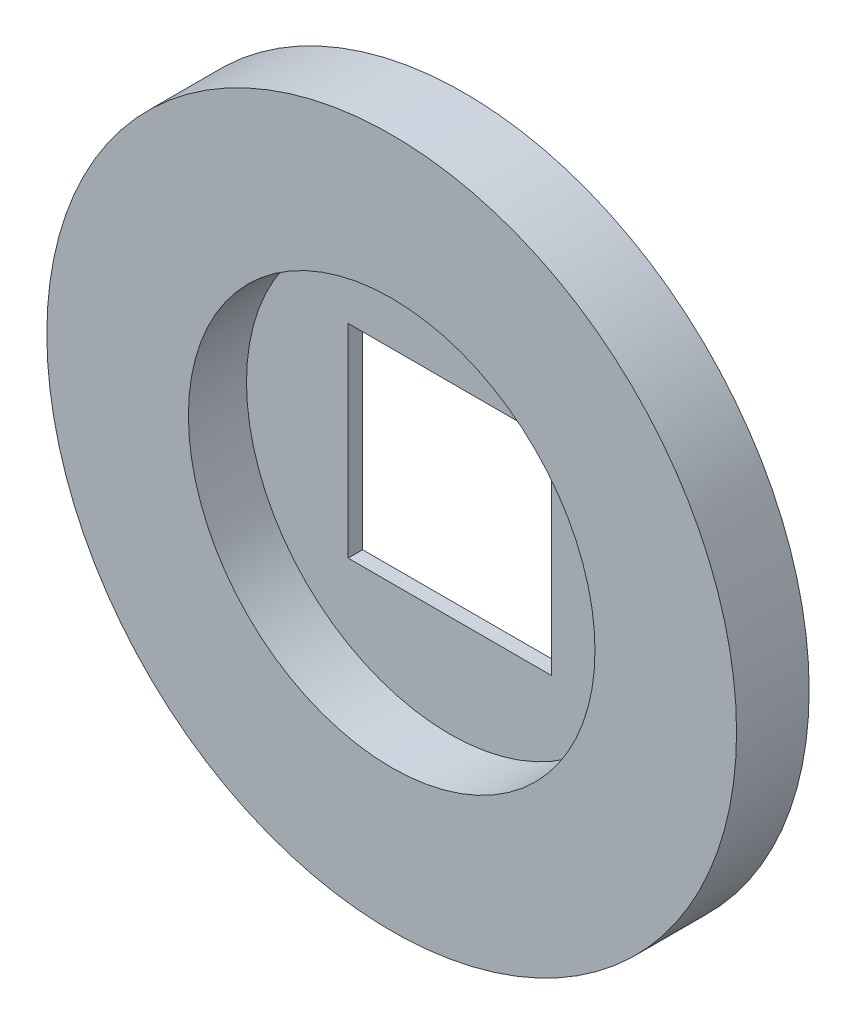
from build123d import *

# Parameters (mm, degrees)
ESQUISSE1_R             = 47.5
BASE_EXTRUSION_DEPTH    = 10
ESQUISSE2_R             = 28
ENL_V_MAT_EXTRU_1_DEPTH = 8
ESQUISSE3_W             = 28
ESQUISSE3_H             = 28
ENL_V_MAT_EXTRU_2_DEPTH = 68.649833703


with BuildPart() as part:
    # Esquisse1 → Base-Extrusion (new body)
    with BuildSketch(Plane.XY):
        Circle(ESQUISSE1_R)
    extrude(amount=BASE_EXTRUSION_DEPTH)

    # Esquisse2 → Enl_v. mat.-Extru.1 (cut)
    with BuildSketch(Plane.XY.offset(10)):
        Circle(ESQUISSE2_R)
    extrude(amount=-ENL_V_MAT_EXTRU_1_DEPTH, mode=Mode.SUBTRACT)

    # Esquisse3 → Enl_v. mat.-Extru.2 (cut, through all)
    with BuildSketch(Plane.XY.offset(2)):
        Rectangle(ESQUISSE3_W, ESQUISSE3_H)
    extrude(amount=-ENL_V_MAT_EXTRU_2_DEPTH, mode=Mode.SUBTRACT)


solid = part.part
